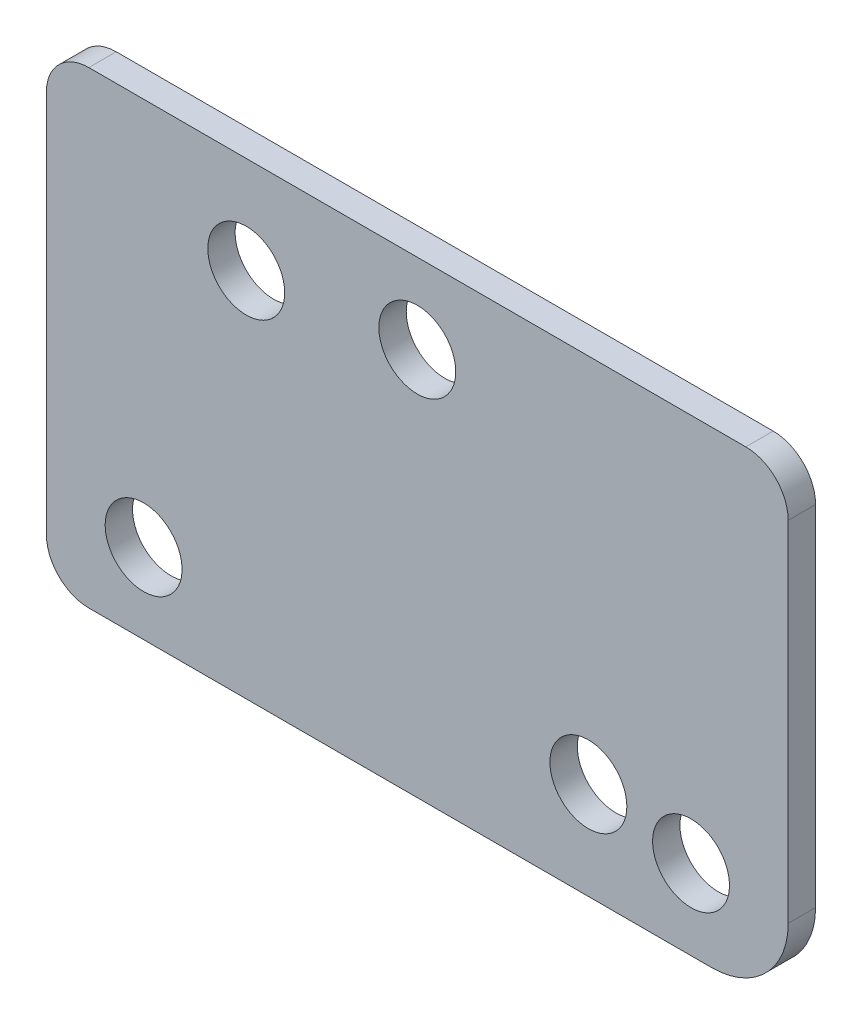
ISO-10303-21;
HEADER;
FILE_DESCRIPTION(('STEP AP214'),'2;1');
FILE_NAME('part.step','',(''),(''),'','','');
FILE_SCHEMA(('AUTOMOTIVE_DESIGN { 1 0 10303 214 1 1 1 1 }'));
ENDSEC;
DATA;
#1=APPLICATION_CONTEXT('core data for automotive mechanical design processes');
#2=APPLICATION_PROTOCOL_DEFINITION('international standard','automotive_design',2000,#1);
#3=PRODUCT_CONTEXT('',#1,'mechanical');
#4=PRODUCT('Part','Part','',(#3));
#5=PRODUCT_RELATED_PRODUCT_CATEGORY('part','',(#4));
#6=PRODUCT_DEFINITION_FORMATION('','',#4);
#7=PRODUCT_DEFINITION_CONTEXT('part definition',#1,'design');
#8=PRODUCT_DEFINITION('design','',#6,#7);
#9=PRODUCT_DEFINITION_SHAPE('','',#8);
#10=(LENGTH_UNIT() NAMED_UNIT(*) SI_UNIT(.MILLI.,.METRE.));
#11=(NAMED_UNIT(*) PLANE_ANGLE_UNIT() SI_UNIT($,.RADIAN.));
#12=(NAMED_UNIT(*) SI_UNIT($,.STERADIAN.) SOLID_ANGLE_UNIT());
#13=UNCERTAINTY_MEASURE_WITH_UNIT(LENGTH_MEASURE(1.E-05),#10,'distance_accuracy_value','');
#14=(GEOMETRIC_REPRESENTATION_CONTEXT(3) GLOBAL_UNCERTAINTY_ASSIGNED_CONTEXT((#13)) GLOBAL_UNIT_ASSIGNED_CONTEXT((#10,
#11,#12)) REPRESENTATION_CONTEXT('',''));
#15=CARTESIAN_POINT('',(0.,0.,0.));
#16=DIRECTION('',(0.,0.,1.));
#17=DIRECTION('',(1.,0.,0.));
#18=AXIS2_PLACEMENT_3D('',#15,#16,#17);
#19=CARTESIAN_POINT('',(-898.04829577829,-48.7304062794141,84.6582));
#20=DIRECTION('',(0.,0.,-1.));
#21=DIRECTION('',(-1.,0.,0.));
#22=AXIS2_PLACEMENT_3D('',#19,#20,#21);
#23=CYLINDRICAL_SURFACE('',#22,3.93700000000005);
#24=CARTESIAN_POINT('',(-898.04829577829,-48.7304062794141,82.1182));
#25=DIRECTION('',(0.,0.,-1.));
#26=DIRECTION('',(-1.,0.,0.));
#27=AXIS2_PLACEMENT_3D('',#24,#25,#26);
#28=CIRCLE('',#27,3.93700000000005);
#29=CARTESIAN_POINT('',(-898.04829577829,-52.6674062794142,82.1182));
#30=VERTEX_POINT('',#29);
#31=CARTESIAN_POINT('',(-901.98529577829,-48.7304062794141,82.1182));
#32=VERTEX_POINT('',#31);
#33=EDGE_CURVE('E155',#30,#32,#28,.T.);
#34=ORIENTED_EDGE('',*,*,#33,.F.);
#35=DIRECTION('',(0.,0.,-1.));
#36=VECTOR('',#35,1.);
#37=CARTESIAN_POINT('',(-898.04829577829,-52.6674062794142,84.6582));
#38=LINE('',#37,#36);
#39=CARTESIAN_POINT('',(-898.04829577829,-52.6674062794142,84.6582));
#40=VERTEX_POINT('',#39);
#41=EDGE_CURVE('E11',#40,#30,#38,.T.);
#42=ORIENTED_EDGE('',*,*,#41,.F.);
#43=CARTESIAN_POINT('',(-898.04829577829,-48.7304062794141,84.6582));
#44=DIRECTION('',(0.,0.,-1.));
#45=DIRECTION('',(-1.,0.,0.));
#46=AXIS2_PLACEMENT_3D('',#43,#44,#45);
#47=CIRCLE('',#46,3.93700000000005);
#48=CARTESIAN_POINT('',(-901.98529577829,-48.7304062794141,84.6582));
#49=VERTEX_POINT('',#48);
#50=EDGE_CURVE('E184',#40,#49,#47,.T.);
#51=ORIENTED_EDGE('',*,*,#50,.T.);
#52=DIRECTION('',(0.,0.,-1.));
#53=VECTOR('',#52,1.);
#54=CARTESIAN_POINT('',(-901.98529577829,-48.7304062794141,84.6582));
#55=LINE('',#54,#53);
#56=EDGE_CURVE('E54',#49,#32,#55,.T.);
#57=ORIENTED_EDGE('',*,*,#56,.T.);
#58=EDGE_LOOP('',(#34,#42,#51,#57));
#59=FACE_BOUND('',#58,.T.);
#60=ADVANCED_FACE('F51',(#59),#23,.T.);
#61=CARTESIAN_POINT('',(-840.26329577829,-52.6674062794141,84.6582));
#62=DIRECTION('',(0.,-1.,0.));
#63=DIRECTION('',(1.,0.,0.));
#64=AXIS2_PLACEMENT_3D('',#61,#62,#63);
#65=PLANE('',#64);
#66=DIRECTION('',(-1.,0.,0.));
#67=VECTOR('',#66,1.);
#68=CARTESIAN_POINT('',(-840.26329577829,-52.6674062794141,82.1182));
#69=LINE('',#68,#67);
#70=CARTESIAN_POINT('',(-840.26329577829,-52.6674062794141,82.1182));
#71=VERTEX_POINT('',#70);
#72=EDGE_CURVE('E181',#71,#30,#69,.T.);
#73=ORIENTED_EDGE('',*,*,#72,.F.);
#74=DIRECTION('',(0.,0.,-1.));
#75=VECTOR('',#74,1.);
#76=CARTESIAN_POINT('',(-840.26329577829,-52.6674062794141,84.6582));
#77=LINE('',#76,#75);
#78=CARTESIAN_POINT('',(-840.26329577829,-52.6674062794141,84.6582));
#79=VERTEX_POINT('',#78);
#80=EDGE_CURVE('E61',#79,#71,#77,.T.);
#81=ORIENTED_EDGE('',*,*,#80,.F.);
#82=DIRECTION('',(-1.,0.,0.));
#83=VECTOR('',#82,1.);
#84=CARTESIAN_POINT('',(-840.26329577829,-52.6674062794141,84.6582));
#85=LINE('',#84,#83);
#86=EDGE_CURVE('E140',#79,#40,#85,.T.);
#87=ORIENTED_EDGE('',*,*,#86,.T.);
#88=ORIENTED_EDGE('',*,*,#41,.T.);
#89=EDGE_LOOP('',(#73,#81,#87,#88));
#90=FACE_BOUND('',#89,.T.);
#91=ADVANCED_FACE('F204',(#90),#65,.T.);
#92=CARTESIAN_POINT('',(-840.26329577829,-45.5554062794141,84.6582));
#93=DIRECTION('',(0.,0.,-1.));
#94=DIRECTION('',(-1.,0.,0.));
#95=AXIS2_PLACEMENT_3D('',#92,#93,#94);
#96=CYLINDRICAL_SURFACE('',#95,7.11199999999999);
#97=CARTESIAN_POINT('',(-840.26329577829,-45.5554062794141,82.1182));
#98=DIRECTION('',(0.,0.,-1.));
#99=DIRECTION('',(-1.,0.,0.));
#100=AXIS2_PLACEMENT_3D('',#97,#98,#99);
#101=CIRCLE('',#100,7.11199999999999);
#102=CARTESIAN_POINT('',(-833.15129577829,-45.5554062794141,82.1182));
#103=VERTEX_POINT('',#102);
#104=EDGE_CURVE('E126',#103,#71,#101,.T.);
#105=ORIENTED_EDGE('',*,*,#104,.F.);
#106=DIRECTION('',(0.,0.,-1.));
#107=VECTOR('',#106,1.);
#108=CARTESIAN_POINT('',(-833.15129577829,-45.5554062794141,84.6582));
#109=LINE('',#108,#107);
#110=CARTESIAN_POINT('',(-833.15129577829,-45.5554062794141,84.6582));
#111=VERTEX_POINT('',#110);
#112=EDGE_CURVE('E121',#111,#103,#109,.T.);
#113=ORIENTED_EDGE('',*,*,#112,.F.);
#114=CARTESIAN_POINT('',(-840.26329577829,-45.5554062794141,84.6582));
#115=DIRECTION('',(0.,0.,-1.));
#116=DIRECTION('',(-1.,0.,0.));
#117=AXIS2_PLACEMENT_3D('',#114,#115,#116);
#118=CIRCLE('',#117,7.11199999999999);
#119=EDGE_CURVE('E124',#111,#79,#118,.T.);
#120=ORIENTED_EDGE('',*,*,#119,.T.);
#121=ORIENTED_EDGE('',*,*,#80,.T.);
#122=EDGE_LOOP('',(#105,#113,#120,#121));
#123=FACE_BOUND('',#122,.T.);
#124=ADVANCED_FACE('F123',(#123),#96,.T.);
#125=CARTESIAN_POINT('',(-833.15129577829,-13.1704062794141,84.6582));
#126=DIRECTION('',(1.,0.,0.));
#127=DIRECTION('',(0.,0.,-1.));
#128=AXIS2_PLACEMENT_3D('',#125,#126,#127);
#129=PLANE('',#128);
#130=DIRECTION('',(0.,-1.,0.));
#131=VECTOR('',#130,1.);
#132=CARTESIAN_POINT('',(-833.15129577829,-13.1704062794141,82.1182));
#133=LINE('',#132,#131);
#134=CARTESIAN_POINT('',(-833.15129577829,-13.1704062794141,82.1182));
#135=VERTEX_POINT('',#134);
#136=EDGE_CURVE('E176',#135,#103,#133,.T.);
#137=ORIENTED_EDGE('',*,*,#136,.F.);
#138=DIRECTION('',(0.,0.,-1.));
#139=VECTOR('',#138,1.);
#140=CARTESIAN_POINT('',(-833.15129577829,-13.1704062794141,84.6582));
#141=LINE('',#140,#139);
#142=CARTESIAN_POINT('',(-833.15129577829,-13.1704062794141,84.6582));
#143=VERTEX_POINT('',#142);
#144=EDGE_CURVE('E132',#143,#135,#141,.T.);
#145=ORIENTED_EDGE('',*,*,#144,.F.);
#146=DIRECTION('',(0.,-1.,0.));
#147=VECTOR('',#146,1.);
#148=CARTESIAN_POINT('',(-833.15129577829,-13.1704062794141,84.6582));
#149=LINE('',#148,#147);
#150=EDGE_CURVE('E138',#143,#111,#149,.T.);
#151=ORIENTED_EDGE('',*,*,#150,.T.);
#152=ORIENTED_EDGE('',*,*,#112,.T.);
#153=EDGE_LOOP('',(#137,#145,#151,#152));
#154=FACE_BOUND('',#153,.T.);
#155=ADVANCED_FACE('F143',(#154),#129,.T.);
#156=CARTESIAN_POINT('',(-837.08829577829,-13.1704062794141,84.6582));
#157=DIRECTION('',(0.,0.,-1.));
#158=DIRECTION('',(-1.,0.,0.));
#159=AXIS2_PLACEMENT_3D('',#156,#157,#158);
#160=CYLINDRICAL_SURFACE('',#159,3.93700000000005);
#161=CARTESIAN_POINT('',(-837.08829577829,-13.1704062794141,82.1182));
#162=DIRECTION('',(0.,0.,-1.));
#163=DIRECTION('',(-1.,0.,0.));
#164=AXIS2_PLACEMENT_3D('',#161,#162,#163);
#165=CIRCLE('',#164,3.93700000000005);
#166=CARTESIAN_POINT('',(-837.08829577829,-9.23340627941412,82.1182));
#167=VERTEX_POINT('',#166);
#168=EDGE_CURVE('E172',#167,#135,#165,.T.);
#169=ORIENTED_EDGE('',*,*,#168,.F.);
#170=DIRECTION('',(0.,0.,-1.));
#171=VECTOR('',#170,1.);
#172=CARTESIAN_POINT('',(-837.08829577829,-9.23340627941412,84.6582));
#173=LINE('',#172,#171);
#174=CARTESIAN_POINT('',(-837.08829577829,-9.23340627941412,84.6582));
#175=VERTEX_POINT('',#174);
#176=EDGE_CURVE('E190',#175,#167,#173,.T.);
#177=ORIENTED_EDGE('',*,*,#176,.F.);
#178=CARTESIAN_POINT('',(-837.08829577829,-13.1704062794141,84.6582));
#179=DIRECTION('',(0.,0.,-1.));
#180=DIRECTION('',(-1.,0.,0.));
#181=AXIS2_PLACEMENT_3D('',#178,#179,#180);
#182=CIRCLE('',#181,3.93700000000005);
#183=EDGE_CURVE('E145',#175,#143,#182,.T.);
#184=ORIENTED_EDGE('',*,*,#183,.T.);
#185=ORIENTED_EDGE('',*,*,#144,.T.);
#186=EDGE_LOOP('',(#169,#177,#184,#185));
#187=FACE_BOUND('',#186,.T.);
#188=ADVANCED_FACE('F217',(#187),#160,.T.);
#189=CARTESIAN_POINT('',(-898.04829577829,-9.2334062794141,84.6582));
#190=DIRECTION('',(0.,1.,0.));
#191=DIRECTION('',(-1.,0.,0.));
#192=AXIS2_PLACEMENT_3D('',#189,#190,#191);
#193=PLANE('',#192);
#194=DIRECTION('',(1.,0.,0.));
#195=VECTOR('',#194,1.);
#196=CARTESIAN_POINT('',(-898.04829577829,-9.2334062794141,82.1182));
#197=LINE('',#196,#195);
#198=CARTESIAN_POINT('',(-898.04829577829,-9.23340627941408,82.1182));
#199=VERTEX_POINT('',#198);
#200=EDGE_CURVE('E168',#199,#167,#197,.T.);
#201=ORIENTED_EDGE('',*,*,#200,.F.);
#202=DIRECTION('',(0.,0.,-1.));
#203=VECTOR('',#202,1.);
#204=CARTESIAN_POINT('',(-898.04829577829,-9.23340627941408,84.6582));
#205=LINE('',#204,#203);
#206=CARTESIAN_POINT('',(-898.04829577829,-9.23340627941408,84.6582));
#207=VERTEX_POINT('',#206);
#208=EDGE_CURVE('E193',#207,#199,#205,.T.);
#209=ORIENTED_EDGE('',*,*,#208,.F.);
#210=DIRECTION('',(1.,0.,0.));
#211=VECTOR('',#210,1.);
#212=CARTESIAN_POINT('',(-898.04829577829,-9.2334062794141,84.6582));
#213=LINE('',#212,#211);
#214=EDGE_CURVE('E149',#207,#175,#213,.T.);
#215=ORIENTED_EDGE('',*,*,#214,.T.);
#216=ORIENTED_EDGE('',*,*,#176,.T.);
#217=EDGE_LOOP('',(#201,#209,#215,#216));
#218=FACE_BOUND('',#217,.T.);
#219=ADVANCED_FACE('F220',(#218),#193,.T.);
#220=CARTESIAN_POINT('',(-898.04829577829,-13.1704062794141,84.6582));
#221=DIRECTION('',(0.,0.,-1.));
#222=DIRECTION('',(-1.,0.,0.));
#223=AXIS2_PLACEMENT_3D('',#220,#221,#222);
#224=CYLINDRICAL_SURFACE('',#223,3.93700000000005);
#225=CARTESIAN_POINT('',(-898.04829577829,-13.1704062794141,82.1182));
#226=DIRECTION('',(0.,0.,-1.));
#227=DIRECTION('',(-1.,0.,0.));
#228=AXIS2_PLACEMENT_3D('',#225,#226,#227);
#229=CIRCLE('',#228,3.93700000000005);
#230=CARTESIAN_POINT('',(-901.98529577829,-13.1704062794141,82.1182));
#231=VERTEX_POINT('',#230);
#232=EDGE_CURVE('E164',#231,#199,#229,.T.);
#233=ORIENTED_EDGE('',*,*,#232,.F.);
#234=DIRECTION('',(0.,0.,-1.));
#235=VECTOR('',#234,1.);
#236=CARTESIAN_POINT('',(-901.98529577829,-13.1704062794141,84.6582));
#237=LINE('',#236,#235);
#238=CARTESIAN_POINT('',(-901.98529577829,-13.1704062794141,84.6582));
#239=VERTEX_POINT('',#238);
#240=EDGE_CURVE('E195',#239,#231,#237,.T.);
#241=ORIENTED_EDGE('',*,*,#240,.F.);
#242=CARTESIAN_POINT('',(-898.04829577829,-13.1704062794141,84.6582));
#243=DIRECTION('',(0.,0.,-1.));
#244=DIRECTION('',(-1.,0.,0.));
#245=AXIS2_PLACEMENT_3D('',#242,#243,#244);
#246=CIRCLE('',#245,3.93700000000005);
#247=EDGE_CURVE('E311',#239,#207,#246,.T.);
#248=ORIENTED_EDGE('',*,*,#247,.T.);
#249=ORIENTED_EDGE('',*,*,#208,.T.);
#250=EDGE_LOOP('',(#233,#241,#248,#249));
#251=FACE_BOUND('',#250,.T.);
#252=ADVANCED_FACE('F224',(#251),#224,.T.);
#253=CARTESIAN_POINT('',(-901.98529577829,-48.7304062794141,84.6582));
#254=DIRECTION('',(-1.,0.,0.));
#255=DIRECTION('',(0.,0.,1.));
#256=AXIS2_PLACEMENT_3D('',#253,#254,#255);
#257=PLANE('',#256);
#258=DIRECTION('',(0.,1.,0.));
#259=VECTOR('',#258,1.);
#260=CARTESIAN_POINT('',(-901.98529577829,-48.7304062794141,82.1182));
#261=LINE('',#260,#259);
#262=EDGE_CURVE('E159',#32,#231,#261,.T.);
#263=ORIENTED_EDGE('',*,*,#262,.F.);
#264=ORIENTED_EDGE('',*,*,#56,.F.);
#265=DIRECTION('',(0.,1.,0.));
#266=VECTOR('',#265,1.);
#267=CARTESIAN_POINT('',(-901.98529577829,-48.7304062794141,84.6582));
#268=LINE('',#267,#266);
#269=EDGE_CURVE('E308',#49,#239,#268,.T.);
#270=ORIENTED_EDGE('',*,*,#269,.T.);
#271=ORIENTED_EDGE('',*,*,#240,.T.);
#272=EDGE_LOOP('',(#263,#264,#270,#271));
#273=FACE_BOUND('',#272,.T.);
#274=ADVANCED_FACE('F201',(#273),#257,.T.);
#275=CARTESIAN_POINT('',(-898.04829577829,-48.7304062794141,84.6582));
#276=DIRECTION('',(0.,0.,-1.));
#277=DIRECTION('',(-1.,0.,0.));
#278=AXIS2_PLACEMENT_3D('',#275,#276,#277);
#279=PLANE('',#278);
#280=CARTESIAN_POINT('',(-851.69329577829,-43.6504062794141,84.6582));
#281=DIRECTION('',(0.,0.,1.));
#282=DIRECTION('',(1.,0.,0.));
#283=AXIS2_PLACEMENT_3D('',#280,#281,#282);
#284=CIRCLE('',#283,3.56869999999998);
#285=CARTESIAN_POINT('',(-848.12459577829,-43.6504062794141,84.6582));
#286=VERTEX_POINT('',#285);
#287=EDGE_CURVE('E268',#286,#286,#284,.T.);
#288=ORIENTED_EDGE('',*,*,#287,.F.);
#289=EDGE_LOOP('',(#288));
#290=FACE_BOUND('',#289,.T.);
#291=CARTESIAN_POINT('',(-883.44329577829,-18.2504062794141,84.6582));
#292=DIRECTION('',(0.,0.,1.));
#293=DIRECTION('',(1.,0.,0.));
#294=AXIS2_PLACEMENT_3D('',#291,#292,#293);
#295=CIRCLE('',#294,3.56869999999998);
#296=CARTESIAN_POINT('',(-879.87459577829,-18.2504062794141,84.6582));
#297=VERTEX_POINT('',#296);
#298=EDGE_CURVE('E276',#297,#297,#295,.T.);
#299=ORIENTED_EDGE('',*,*,#298,.F.);
#300=EDGE_LOOP('',(#299));
#301=FACE_BOUND('',#300,.T.);
#302=CARTESIAN_POINT('',(-842.16829577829,-45.2379062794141,84.6582));
#303=DIRECTION('',(0.,0.,-1.));
#304=DIRECTION('',(-1.,0.,0.));
#305=AXIS2_PLACEMENT_3D('',#302,#303,#304);
#306=CIRCLE('',#305,3.56869999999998);
#307=CARTESIAN_POINT('',(-845.73699577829,-45.2379062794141,84.6582));
#308=VERTEX_POINT('',#307);
#309=EDGE_CURVE('E283',#308,#308,#306,.T.);
#310=ORIENTED_EDGE('',*,*,#309,.T.);
#311=EDGE_LOOP('',(#310));
#312=FACE_BOUND('',#311,.T.);
#313=CARTESIAN_POINT('',(-892.96829577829,-45.2379062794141,84.6582));
#314=DIRECTION('',(0.,0.,-1.));
#315=DIRECTION('',(-1.,0.,0.));
#316=AXIS2_PLACEMENT_3D('',#313,#314,#315);
#317=CIRCLE('',#316,3.56869999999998);
#318=CARTESIAN_POINT('',(-896.53699577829,-45.2379062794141,84.6582));
#319=VERTEX_POINT('',#318);
#320=EDGE_CURVE('E291',#319,#319,#317,.T.);
#321=ORIENTED_EDGE('',*,*,#320,.T.);
#322=EDGE_LOOP('',(#321));
#323=FACE_BOUND('',#322,.T.);
#324=CARTESIAN_POINT('',(-867.56829577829,-16.6629062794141,84.6582));
#325=DIRECTION('',(0.,0.,-1.));
#326=DIRECTION('',(-1.,0.,0.));
#327=AXIS2_PLACEMENT_3D('',#324,#325,#326);
#328=CIRCLE('',#327,3.56869999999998);
#329=CARTESIAN_POINT('',(-871.13699577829,-16.6629062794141,84.6582));
#330=VERTEX_POINT('',#329);
#331=EDGE_CURVE('E299',#330,#330,#328,.T.);
#332=ORIENTED_EDGE('',*,*,#331,.T.);
#333=EDGE_LOOP('',(#332));
#334=FACE_BOUND('',#333,.T.);
#335=ORIENTED_EDGE('',*,*,#50,.F.);
#336=ORIENTED_EDGE('',*,*,#86,.F.);
#337=ORIENTED_EDGE('',*,*,#119,.F.);
#338=ORIENTED_EDGE('',*,*,#150,.F.);
#339=ORIENTED_EDGE('',*,*,#183,.F.);
#340=ORIENTED_EDGE('',*,*,#214,.F.);
#341=ORIENTED_EDGE('',*,*,#247,.F.);
#342=ORIENTED_EDGE('',*,*,#269,.F.);
#343=EDGE_LOOP('',(#335,#336,#337,#338,#339,#340,#341,#342));
#344=FACE_BOUND('',#343,.T.);
#345=ADVANCED_FACE('F136',(#290,#301,#312,#323,#334,#344),#279,.F.);
#346=CARTESIAN_POINT('',(-898.04829577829,-48.7304062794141,82.1182));
#347=DIRECTION('',(0.,0.,-1.));
#348=DIRECTION('',(-1.,0.,0.));
#349=AXIS2_PLACEMENT_3D('',#346,#347,#348);
#350=PLANE('',#349);
#351=CARTESIAN_POINT('',(-851.69329577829,-43.6504062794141,82.1182));
#352=DIRECTION('',(0.,0.,1.));
#353=DIRECTION('',(1.,0.,0.));
#354=AXIS2_PLACEMENT_3D('',#351,#352,#353);
#355=CIRCLE('',#354,3.56869999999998);
#356=CARTESIAN_POINT('',(-848.12459577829,-43.6504062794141,82.1182));
#357=VERTEX_POINT('',#356);
#358=EDGE_CURVE('E266',#357,#357,#355,.T.);
#359=ORIENTED_EDGE('',*,*,#358,.T.);
#360=EDGE_LOOP('',(#359));
#361=FACE_BOUND('',#360,.T.);
#362=CARTESIAN_POINT('',(-883.44329577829,-18.2504062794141,82.1182));
#363=DIRECTION('',(0.,0.,1.));
#364=DIRECTION('',(1.,0.,0.));
#365=AXIS2_PLACEMENT_3D('',#362,#363,#364);
#366=CIRCLE('',#365,3.56869999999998);
#367=CARTESIAN_POINT('',(-879.87459577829,-18.2504062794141,82.1182));
#368=VERTEX_POINT('',#367);
#369=EDGE_CURVE('E270',#368,#368,#366,.T.);
#370=ORIENTED_EDGE('',*,*,#369,.T.);
#371=EDGE_LOOP('',(#370));
#372=FACE_BOUND('',#371,.T.);
#373=CARTESIAN_POINT('',(-842.16829577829,-45.2379062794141,82.1182));
#374=DIRECTION('',(0.,0.,-1.));
#375=DIRECTION('',(-1.,0.,0.));
#376=AXIS2_PLACEMENT_3D('',#373,#374,#375);
#377=CIRCLE('',#376,3.56869999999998);
#378=CARTESIAN_POINT('',(-845.73699577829,-45.2379062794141,82.1182));
#379=VERTEX_POINT('',#378);
#380=EDGE_CURVE('E287',#379,#379,#377,.T.);
#381=ORIENTED_EDGE('',*,*,#380,.F.);
#382=EDGE_LOOP('',(#381));
#383=FACE_BOUND('',#382,.T.);
#384=CARTESIAN_POINT('',(-892.96829577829,-45.2379062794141,82.1182));
#385=DIRECTION('',(0.,0.,-1.));
#386=DIRECTION('',(-1.,0.,0.));
#387=AXIS2_PLACEMENT_3D('',#384,#385,#386);
#388=CIRCLE('',#387,3.56869999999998);
#389=CARTESIAN_POINT('',(-896.53699577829,-45.2379062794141,82.1182));
#390=VERTEX_POINT('',#389);
#391=EDGE_CURVE('E295',#390,#390,#388,.T.);
#392=ORIENTED_EDGE('',*,*,#391,.F.);
#393=EDGE_LOOP('',(#392));
#394=FACE_BOUND('',#393,.T.);
#395=CARTESIAN_POINT('',(-867.56829577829,-16.6629062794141,82.1182));
#396=DIRECTION('',(0.,0.,-1.));
#397=DIRECTION('',(-1.,0.,0.));
#398=AXIS2_PLACEMENT_3D('',#395,#396,#397);
#399=CIRCLE('',#398,3.56869999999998);
#400=CARTESIAN_POINT('',(-871.13699577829,-16.6629062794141,82.1182));
#401=VERTEX_POINT('',#400);
#402=EDGE_CURVE('E160',#401,#401,#399,.T.);
#403=ORIENTED_EDGE('',*,*,#402,.F.);
#404=EDGE_LOOP('',(#403));
#405=FACE_BOUND('',#404,.T.);
#406=ORIENTED_EDGE('',*,*,#33,.T.);
#407=ORIENTED_EDGE('',*,*,#262,.T.);
#408=ORIENTED_EDGE('',*,*,#232,.T.);
#409=ORIENTED_EDGE('',*,*,#200,.T.);
#410=ORIENTED_EDGE('',*,*,#168,.T.);
#411=ORIENTED_EDGE('',*,*,#136,.T.);
#412=ORIENTED_EDGE('',*,*,#104,.T.);
#413=ORIENTED_EDGE('',*,*,#72,.T.);
#414=EDGE_LOOP('',(#406,#407,#408,#409,#410,#411,#412,#413));
#415=FACE_BOUND('',#414,.T.);
#416=ADVANCED_FACE('F203',(#361,#372,#383,#394,#405,#415),#350,.T.);
#417=CARTESIAN_POINT('',(-867.56829577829,-16.6629062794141,82.1182));
#418=DIRECTION('',(0.,0.,-1.));
#419=DIRECTION('',(-1.,0.,0.));
#420=AXIS2_PLACEMENT_3D('',#417,#418,#419);
#421=CYLINDRICAL_SURFACE('',#420,3.56869999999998);
#422=ORIENTED_EDGE('',*,*,#331,.F.);
#423=EDGE_LOOP('',(#422));
#424=FACE_BOUND('',#423,.T.);
#425=ORIENTED_EDGE('',*,*,#402,.T.);
#426=EDGE_LOOP('',(#425));
#427=FACE_BOUND('',#426,.T.);
#428=ADVANCED_FACE('F238',(#424,#427),#421,.F.);
#429=CARTESIAN_POINT('',(-892.96829577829,-45.2379062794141,82.1182));
#430=DIRECTION('',(0.,0.,-1.));
#431=DIRECTION('',(-1.,0.,0.));
#432=AXIS2_PLACEMENT_3D('',#429,#430,#431);
#433=CYLINDRICAL_SURFACE('',#432,3.56869999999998);
#434=ORIENTED_EDGE('',*,*,#320,.F.);
#435=EDGE_LOOP('',(#434));
#436=FACE_BOUND('',#435,.T.);
#437=ORIENTED_EDGE('',*,*,#391,.T.);
#438=EDGE_LOOP('',(#437));
#439=FACE_BOUND('',#438,.T.);
#440=ADVANCED_FACE('F245',(#436,#439),#433,.F.);
#441=CARTESIAN_POINT('',(-842.16829577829,-45.2379062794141,82.1182));
#442=DIRECTION('',(0.,0.,-1.));
#443=DIRECTION('',(-1.,0.,0.));
#444=AXIS2_PLACEMENT_3D('',#441,#442,#443);
#445=CYLINDRICAL_SURFACE('',#444,3.56869999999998);
#446=ORIENTED_EDGE('',*,*,#309,.F.);
#447=EDGE_LOOP('',(#446));
#448=FACE_BOUND('',#447,.T.);
#449=ORIENTED_EDGE('',*,*,#380,.T.);
#450=EDGE_LOOP('',(#449));
#451=FACE_BOUND('',#450,.T.);
#452=ADVANCED_FACE('F249',(#448,#451),#445,.F.);
#453=CARTESIAN_POINT('',(-883.44329577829,-18.2504062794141,84.6582));
#454=DIRECTION('',(0.,0.,1.));
#455=DIRECTION('',(1.,0.,0.));
#456=AXIS2_PLACEMENT_3D('',#453,#454,#455);
#457=CYLINDRICAL_SURFACE('',#456,3.56869999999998);
#458=ORIENTED_EDGE('',*,*,#369,.F.);
#459=EDGE_LOOP('',(#458));
#460=FACE_BOUND('',#459,.T.);
#461=ORIENTED_EDGE('',*,*,#298,.T.);
#462=EDGE_LOOP('',(#461));
#463=FACE_BOUND('',#462,.T.);
#464=ADVANCED_FACE('F253',(#460,#463),#457,.F.);
#465=CARTESIAN_POINT('',(-851.69329577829,-43.6504062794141,84.6582));
#466=DIRECTION('',(0.,0.,1.));
#467=DIRECTION('',(1.,0.,0.));
#468=AXIS2_PLACEMENT_3D('',#465,#466,#467);
#469=CYLINDRICAL_SURFACE('',#468,3.56869999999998);
#470=ORIENTED_EDGE('',*,*,#358,.F.);
#471=EDGE_LOOP('',(#470));
#472=FACE_BOUND('',#471,.T.);
#473=ORIENTED_EDGE('',*,*,#287,.T.);
#474=EDGE_LOOP('',(#473));
#475=FACE_BOUND('',#474,.T.);
#476=ADVANCED_FACE('F257',(#472,#475),#469,.F.);
#477=CLOSED_SHELL('',(#60,#91,#124,#155,#188,#219,#252,#274,#345,#416,#428,#440,#452,#464,#476));
#478=MANIFOLD_SOLID_BREP('B2',#477);
#479=ADVANCED_BREP_SHAPE_REPRESENTATION('',(#18,#478),#14);
#480=SHAPE_DEFINITION_REPRESENTATION(#9,#479);
ENDSEC;
END-ISO-10303-21;
